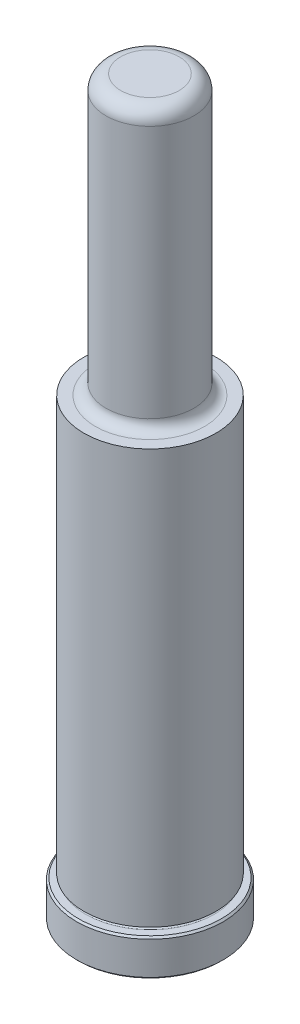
ISO-10303-21;
HEADER;
FILE_DESCRIPTION(('STEP AP214'),'2;1');
FILE_NAME('part.step','',(''),(''),'','','');
FILE_SCHEMA(('AUTOMOTIVE_DESIGN { 1 0 10303 214 1 1 1 1 }'));
ENDSEC;
DATA;
#1=APPLICATION_CONTEXT('core data for automotive mechanical design processes');
#2=APPLICATION_PROTOCOL_DEFINITION('international standard','automotive_design',2000,#1);
#3=PRODUCT_CONTEXT('',#1,'mechanical');
#4=PRODUCT('Part','Part','',(#3));
#5=PRODUCT_RELATED_PRODUCT_CATEGORY('part','',(#4));
#6=PRODUCT_DEFINITION_FORMATION('','',#4);
#7=PRODUCT_DEFINITION_CONTEXT('part definition',#1,'design');
#8=PRODUCT_DEFINITION('design','',#6,#7);
#9=PRODUCT_DEFINITION_SHAPE('','',#8);
#10=(LENGTH_UNIT() NAMED_UNIT(*) SI_UNIT(.MILLI.,.METRE.));
#11=(NAMED_UNIT(*) PLANE_ANGLE_UNIT() SI_UNIT($,.RADIAN.));
#12=(NAMED_UNIT(*) SI_UNIT($,.STERADIAN.) SOLID_ANGLE_UNIT());
#13=UNCERTAINTY_MEASURE_WITH_UNIT(LENGTH_MEASURE(1.E-05),#10,'distance_accuracy_value','');
#14=(GEOMETRIC_REPRESENTATION_CONTEXT(3) GLOBAL_UNCERTAINTY_ASSIGNED_CONTEXT((#13)) GLOBAL_UNIT_ASSIGNED_CONTEXT((#10,
#11,#12)) REPRESENTATION_CONTEXT('',''));
#15=CARTESIAN_POINT('',(0.,0.,0.));
#16=DIRECTION('',(0.,0.,1.));
#17=DIRECTION('',(1.,0.,0.));
#18=AXIS2_PLACEMENT_3D('',#15,#16,#17);
#19=CARTESIAN_POINT('',(0.,0.,0.));
#20=DIRECTION('',(0.,1.,0.));
#21=DIRECTION('',(0.,0.,1.));
#22=AXIS2_PLACEMENT_3D('',#19,#20,#21);
#23=PLANE('',#22);
#24=CARTESIAN_POINT('',(0.,0.,0.));
#25=DIRECTION('',(0.,1.,0.));
#26=DIRECTION('',(0.,0.,1.));
#27=AXIS2_PLACEMENT_3D('',#24,#25,#26);
#28=CIRCLE('',#27,15.494);
#29=CARTESIAN_POINT('',(0.,0.,15.494));
#30=VERTEX_POINT('',#29);
#31=EDGE_CURVE('E46',#30,#30,#28,.F.);
#32=ORIENTED_EDGE('',*,*,#31,.T.);
#33=EDGE_LOOP('',(#32));
#34=FACE_BOUND('',#33,.T.);
#35=ADVANCED_FACE('F31',(#34),#23,.F.);
#36=CARTESIAN_POINT('',(0.,0.,0.));
#37=DIRECTION('',(0.,1.,0.));
#38=DIRECTION('',(0.,0.,1.));
#39=AXIS2_PLACEMENT_3D('',#36,#37,#38);
#40=CYLINDRICAL_SURFACE('',#39,15.875);
#41=CARTESIAN_POINT('',(0.,0.381000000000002,0.));
#42=DIRECTION('',(0.,1.,0.));
#43=DIRECTION('',(0.,0.,1.));
#44=AXIS2_PLACEMENT_3D('',#41,#42,#43);
#45=CIRCLE('',#44,15.875);
#46=CARTESIAN_POINT('',(0.,0.381,15.875));
#47=VERTEX_POINT('',#46);
#48=EDGE_CURVE('E51',#47,#47,#45,.T.);
#49=ORIENTED_EDGE('',*,*,#48,.T.);
#50=EDGE_LOOP('',(#49));
#51=FACE_BOUND('',#50,.T.);
#52=CARTESIAN_POINT('',(0.,7.54380000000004,0.));
#53=DIRECTION('',(0.,-1.,0.));
#54=DIRECTION('',(0.,0.,-1.));
#55=AXIS2_PLACEMENT_3D('',#52,#53,#54);
#56=CIRCLE('',#55,15.875);
#57=CARTESIAN_POINT('',(0.,7.54380000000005,-15.875));
#58=VERTEX_POINT('',#57);
#59=EDGE_CURVE('E54',#58,#58,#56,.T.);
#60=ORIENTED_EDGE('',*,*,#59,.T.);
#61=EDGE_LOOP('',(#60));
#62=FACE_BOUND('',#61,.T.);
#63=ADVANCED_FACE('F110',(#51,#62),#40,.T.);
#64=CARTESIAN_POINT('',(0.,7.9248,-15.875));
#65=DIRECTION('',(0.,-1.,0.));
#66=DIRECTION('',(0.,0.,-1.));
#67=AXIS2_PLACEMENT_3D('',#64,#65,#66);
#68=PLANE('',#67);
#69=CARTESIAN_POINT('',(0.,7.9248,0.));
#70=DIRECTION('',(0.,-1.,0.));
#71=DIRECTION('',(0.,0.,-1.));
#72=AXIS2_PLACEMENT_3D('',#69,#70,#71);
#73=CIRCLE('',#72,15.494);
#74=CARTESIAN_POINT('',(0.,7.9248,-15.494));
#75=VERTEX_POINT('',#74);
#76=EDGE_CURVE('E42',#75,#75,#73,.F.);
#77=ORIENTED_EDGE('',*,*,#76,.T.);
#78=EDGE_LOOP('',(#77));
#79=FACE_BOUND('',#78,.T.);
#80=CARTESIAN_POINT('',(0.,7.9248,0.));
#81=DIRECTION('',(0.,1.,0.));
#82=DIRECTION('',(0.,0.,1.));
#83=AXIS2_PLACEMENT_3D('',#80,#81,#82);
#84=CIRCLE('',#83,13.8938);
#85=CARTESIAN_POINT('',(0.,7.9248,13.8938));
#86=VERTEX_POINT('',#85);
#87=EDGE_CURVE('E57',#86,#86,#84,.T.);
#88=ORIENTED_EDGE('',*,*,#87,.F.);
#89=EDGE_LOOP('',(#88));
#90=FACE_BOUND('',#89,.T.);
#91=ADVANCED_FACE('F105',(#79,#90),#68,.F.);
#92=CARTESIAN_POINT('',(0.,8.3058,0.));
#93=DIRECTION('',(0.,1.,0.));
#94=DIRECTION('',(0.,0.,1.));
#95=AXIS2_PLACEMENT_3D('',#92,#93,#94);
#96=TOROIDAL_SURFACE('',#95,13.8938,0.381000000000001);
#97=CARTESIAN_POINT('',(0.,8.68680000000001,0.));
#98=DIRECTION('',(0.,1.,0.));
#99=DIRECTION('',(0.,0.,1.));
#100=AXIS2_PLACEMENT_3D('',#97,#98,#99);
#101=CIRCLE('',#100,13.8938);
#102=CARTESIAN_POINT('',(0.,8.6868,13.8938));
#103=VERTEX_POINT('',#102);
#104=EDGE_CURVE('E60',#103,#103,#101,.T.);
#105=ORIENTED_EDGE('',*,*,#104,.F.);
#106=EDGE_LOOP('',(#105));
#107=FACE_BOUND('',#106,.T.);
#108=ORIENTED_EDGE('',*,*,#87,.T.);
#109=EDGE_LOOP('',(#108));
#110=FACE_BOUND('',#109,.T.);
#111=ADVANCED_FACE('F99',(#107,#110),#96,.F.);
#112=CARTESIAN_POINT('',(0.,8.68680000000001,-13.8938));
#113=DIRECTION('',(0.,1.,0.));
#114=DIRECTION('',(0.,0.,1.));
#115=AXIS2_PLACEMENT_3D('',#112,#113,#114);
#116=PLANE('',#115);
#117=CARTESIAN_POINT('',(0.,8.6868,0.));
#118=DIRECTION('',(0.,1.,0.));
#119=DIRECTION('',(0.,0.,1.));
#120=AXIS2_PLACEMENT_3D('',#117,#118,#119);
#121=CIRCLE('',#120,14.3002);
#122=CARTESIAN_POINT('',(0.,8.6868,14.3002));
#123=VERTEX_POINT('',#122);
#124=EDGE_CURVE('E63',#123,#123,#121,.T.);
#125=ORIENTED_EDGE('',*,*,#124,.F.);
#126=EDGE_LOOP('',(#125));
#127=FACE_BOUND('',#126,.T.);
#128=ORIENTED_EDGE('',*,*,#104,.T.);
#129=EDGE_LOOP('',(#128));
#130=FACE_BOUND('',#129,.T.);
#131=ADVANCED_FACE('F93',(#127,#130),#116,.F.);
#132=CARTESIAN_POINT('',(0.,0.,0.));
#133=DIRECTION('',(0.,1.,0.));
#134=DIRECTION('',(0.,0.,1.));
#135=AXIS2_PLACEMENT_3D('',#132,#133,#134);
#136=CYLINDRICAL_SURFACE('',#135,14.3002);
#137=CARTESIAN_POINT('',(0.,98.425,0.));
#138=DIRECTION('',(0.,1.,0.));
#139=DIRECTION('',(0.,0.,1.));
#140=AXIS2_PLACEMENT_3D('',#137,#138,#139);
#141=CIRCLE('',#140,14.3002);
#142=CARTESIAN_POINT('',(0.,98.425,14.3002));
#143=VERTEX_POINT('',#142);
#144=EDGE_CURVE('E66',#143,#143,#141,.T.);
#145=ORIENTED_EDGE('',*,*,#144,.F.);
#146=EDGE_LOOP('',(#145));
#147=FACE_BOUND('',#146,.T.);
#148=ORIENTED_EDGE('',*,*,#124,.T.);
#149=EDGE_LOOP('',(#148));
#150=FACE_BOUND('',#149,.T.);
#151=ADVANCED_FACE('F87',(#147,#150),#136,.T.);
#152=CARTESIAN_POINT('',(0.,98.425,-14.3002));
#153=DIRECTION('',(0.,-1.,0.));
#154=DIRECTION('',(0.,0.,-1.));
#155=AXIS2_PLACEMENT_3D('',#152,#153,#154);
#156=PLANE('',#155);
#157=CARTESIAN_POINT('',(0.,98.425,0.));
#158=DIRECTION('',(0.,1.,0.));
#159=DIRECTION('',(0.,0.,1.));
#160=AXIS2_PLACEMENT_3D('',#157,#158,#159);
#161=CIRCLE('',#160,11.7983);
#162=CARTESIAN_POINT('',(0.,98.425,11.7983));
#163=VERTEX_POINT('',#162);
#164=EDGE_CURVE('E69',#163,#163,#161,.T.);
#165=ORIENTED_EDGE('',*,*,#164,.F.);
#166=EDGE_LOOP('',(#165));
#167=FACE_BOUND('',#166,.T.);
#168=ORIENTED_EDGE('',*,*,#144,.T.);
#169=EDGE_LOOP('',(#168));
#170=FACE_BOUND('',#169,.T.);
#171=ADVANCED_FACE('F81',(#167,#170),#156,.F.);
#172=CARTESIAN_POINT('',(0.,100.711,0.));
#173=DIRECTION('',(0.,1.,0.));
#174=DIRECTION('',(0.,0.,1.));
#175=AXIS2_PLACEMENT_3D('',#172,#173,#174);
#176=TOROIDAL_SURFACE('',#175,11.7983,2.286);
#177=CARTESIAN_POINT('',(0.,100.711,0.));
#178=DIRECTION('',(0.,1.,0.));
#179=DIRECTION('',(0.,0.,1.));
#180=AXIS2_PLACEMENT_3D('',#177,#178,#179);
#181=CIRCLE('',#180,9.5123);
#182=CARTESIAN_POINT('',(0.,100.711,9.51230000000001));
#183=VERTEX_POINT('',#182);
#184=EDGE_CURVE('E72',#183,#183,#181,.T.);
#185=ORIENTED_EDGE('',*,*,#184,.F.);
#186=EDGE_LOOP('',(#185));
#187=FACE_BOUND('',#186,.T.);
#188=ORIENTED_EDGE('',*,*,#164,.T.);
#189=EDGE_LOOP('',(#188));
#190=FACE_BOUND('',#189,.T.);
#191=ADVANCED_FACE('F78',(#187,#190),#176,.F.);
#192=CARTESIAN_POINT('',(0.,0.,0.));
#193=DIRECTION('',(0.,1.,0.));
#194=DIRECTION('',(0.,0.,1.));
#195=AXIS2_PLACEMENT_3D('',#192,#193,#194);
#196=CYLINDRICAL_SURFACE('',#195,9.51230000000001);
#197=CARTESIAN_POINT('',(0.,155.575,0.));
#198=DIRECTION('',(0.,-1.,0.));
#199=DIRECTION('',(0.,0.,-1.));
#200=AXIS2_PLACEMENT_3D('',#197,#198,#199);
#201=CIRCLE('',#200,9.51230000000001);
#202=CARTESIAN_POINT('',(0.,155.575,-9.51229999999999));
#203=VERTEX_POINT('',#202);
#204=EDGE_CURVE('E10',#203,#203,#201,.T.);
#205=ORIENTED_EDGE('',*,*,#204,.T.);
#206=EDGE_LOOP('',(#205));
#207=FACE_BOUND('',#206,.T.);
#208=ORIENTED_EDGE('',*,*,#184,.T.);
#209=EDGE_LOOP('',(#208));
#210=FACE_BOUND('',#209,.T.);
#211=ADVANCED_FACE('F76',(#207,#210),#196,.T.);
#212=CARTESIAN_POINT('',(0.,158.75,-9.51229999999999));
#213=DIRECTION('',(0.,-1.,0.));
#214=DIRECTION('',(0.,0.,-1.));
#215=AXIS2_PLACEMENT_3D('',#212,#213,#214);
#216=PLANE('',#215);
#217=CARTESIAN_POINT('',(0.,158.75,0.));
#218=DIRECTION('',(0.,-1.,0.));
#219=DIRECTION('',(0.,0.,-1.));
#220=AXIS2_PLACEMENT_3D('',#217,#218,#219);
#221=CIRCLE('',#220,6.33730000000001);
#222=CARTESIAN_POINT('',(0.,158.75,-6.33729999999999));
#223=VERTEX_POINT('',#222);
#224=EDGE_CURVE('E38',#223,#223,#221,.F.);
#225=ORIENTED_EDGE('',*,*,#224,.T.);
#226=EDGE_LOOP('',(#225));
#227=FACE_BOUND('',#226,.T.);
#228=ADVANCED_FACE('F127',(#227),#216,.F.);
#229=CARTESIAN_POINT('',(0.,0.381000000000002,0.));
#230=DIRECTION('',(0.,1.,0.));
#231=DIRECTION('',(0.,0.,1.));
#232=AXIS2_PLACEMENT_3D('',#229,#230,#231);
#233=CONICAL_SURFACE('',#232,15.875,0.785398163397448);
#234=ORIENTED_EDGE('',*,*,#31,.F.);
#235=EDGE_LOOP('',(#234));
#236=FACE_BOUND('',#235,.T.);
#237=ORIENTED_EDGE('',*,*,#48,.F.);
#238=EDGE_LOOP('',(#237));
#239=FACE_BOUND('',#238,.T.);
#240=ADVANCED_FACE('F124',(#236,#239),#233,.T.);
#241=CARTESIAN_POINT('',(0.,7.9248,0.));
#242=DIRECTION('',(0.,-1.,0.));
#243=DIRECTION('',(0.,0.,-1.));
#244=AXIS2_PLACEMENT_3D('',#241,#242,#243);
#245=CONICAL_SURFACE('',#244,15.494,0.78539816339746);
#246=ORIENTED_EDGE('',*,*,#59,.F.);
#247=EDGE_LOOP('',(#246));
#248=FACE_BOUND('',#247,.T.);
#249=ORIENTED_EDGE('',*,*,#76,.F.);
#250=EDGE_LOOP('',(#249));
#251=FACE_BOUND('',#250,.T.);
#252=ADVANCED_FACE('F126',(#248,#251),#245,.T.);
#253=CARTESIAN_POINT('',(0.,155.575,0.));
#254=DIRECTION('',(0.,-1.,0.));
#255=DIRECTION('',(0.,0.,-1.));
#256=AXIS2_PLACEMENT_3D('',#253,#254,#255);
#257=TOROIDAL_SURFACE('',#256,6.33730000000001,3.175);
#258=ORIENTED_EDGE('',*,*,#204,.F.);
#259=EDGE_LOOP('',(#258));
#260=FACE_BOUND('',#259,.T.);
#261=ORIENTED_EDGE('',*,*,#224,.F.);
#262=EDGE_LOOP('',(#261));
#263=FACE_BOUND('',#262,.T.);
#264=ADVANCED_FACE('F33',(#260,#263),#257,.T.);
#265=CLOSED_SHELL('',(#35,#63,#91,#111,#131,#151,#171,#191,#211,#228,#240,#252,#264));
#266=MANIFOLD_SOLID_BREP('B2',#265);
#267=ADVANCED_BREP_SHAPE_REPRESENTATION('',(#18,#266),#14);
#268=SHAPE_DEFINITION_REPRESENTATION(#9,#267);
ENDSEC;
END-ISO-10303-21;
